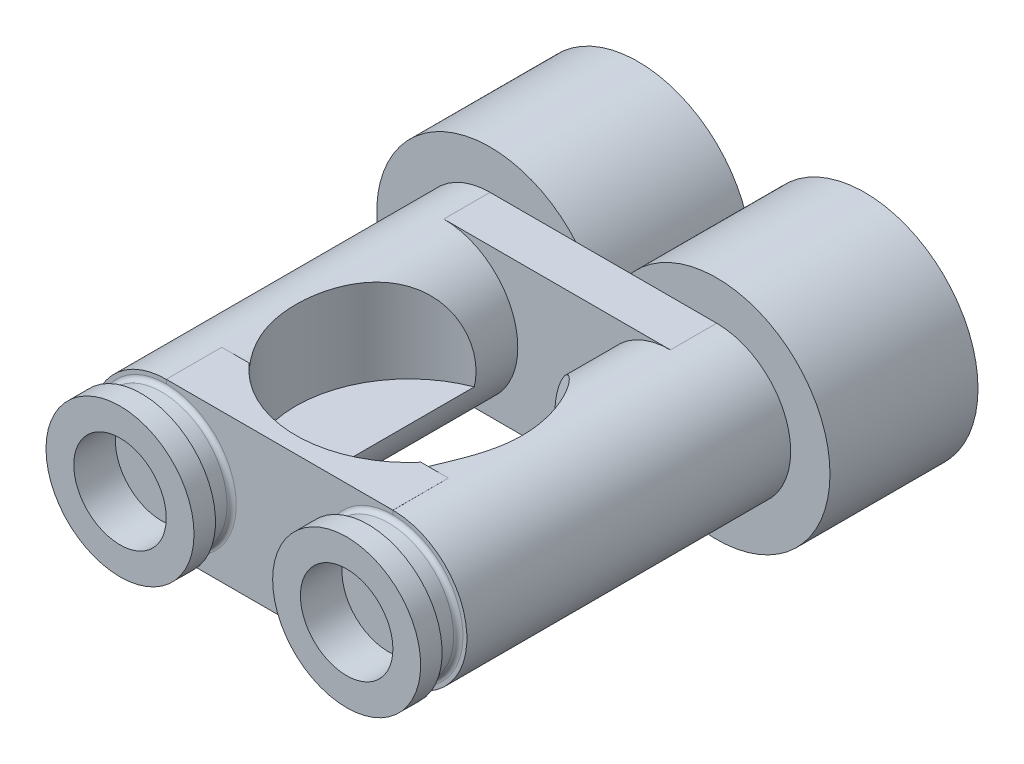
ISO-10303-21;
HEADER;
FILE_DESCRIPTION(('STEP AP214'),'2;1');
FILE_NAME('part.step','',(''),(''),'','','');
FILE_SCHEMA(('AUTOMOTIVE_DESIGN { 1 0 10303 214 1 1 1 1 }'));
ENDSEC;
DATA;
#1=APPLICATION_CONTEXT('core data for automotive mechanical design processes');
#2=APPLICATION_PROTOCOL_DEFINITION('international standard','automotive_design',2000,#1);
#3=PRODUCT_CONTEXT('',#1,'mechanical');
#4=PRODUCT('Part','Part','',(#3));
#5=PRODUCT_RELATED_PRODUCT_CATEGORY('part','',(#4));
#6=PRODUCT_DEFINITION_FORMATION('','',#4);
#7=PRODUCT_DEFINITION_CONTEXT('part definition',#1,'design');
#8=PRODUCT_DEFINITION('design','',#6,#7);
#9=PRODUCT_DEFINITION_SHAPE('','',#8);
#10=(LENGTH_UNIT() NAMED_UNIT(*) SI_UNIT(.MILLI.,.METRE.));
#11=(NAMED_UNIT(*) PLANE_ANGLE_UNIT() SI_UNIT($,.RADIAN.));
#12=(NAMED_UNIT(*) SI_UNIT($,.STERADIAN.) SOLID_ANGLE_UNIT());
#13=UNCERTAINTY_MEASURE_WITH_UNIT(LENGTH_MEASURE(1.E-05),#10,'distance_accuracy_value','');
#14=(GEOMETRIC_REPRESENTATION_CONTEXT(3) GLOBAL_UNCERTAINTY_ASSIGNED_CONTEXT((#13)) GLOBAL_UNIT_ASSIGNED_CONTEXT((#10,
#11,#12)) REPRESENTATION_CONTEXT('',''));
#15=CARTESIAN_POINT('',(0.,0.,0.));
#16=DIRECTION('',(0.,0.,1.));
#17=DIRECTION('',(1.,0.,0.));
#18=AXIS2_PLACEMENT_3D('',#15,#16,#17);
#19=CARTESIAN_POINT('',(0.,1.6,4.2));
#20=DIRECTION('',(1.,0.,0.));
#21=DIRECTION('',(0.,0.,-1.));
#22=AXIS2_PLACEMENT_3D('',#19,#20,#21);
#23=PLANE('',#22);
#24=DIRECTION('',(0.,-1.,0.));
#25=VECTOR('',#24,1.);
#26=CARTESIAN_POINT('',(0.,1.6,3.2));
#27=LINE('',#26,#25);
#28=CARTESIAN_POINT('',(0.,1.6,3.2));
#29=VERTEX_POINT('',#28);
#30=CARTESIAN_POINT('',(0.,-1.6,3.2));
#31=VERTEX_POINT('',#30);
#32=EDGE_CURVE('E81',#29,#31,#27,.T.);
#33=ORIENTED_EDGE('',*,*,#32,.T.);
#34=DIRECTION('',(0.,0.,-1.));
#35=VECTOR('',#34,1.);
#36=CARTESIAN_POINT('',(0.,-1.6,4.2));
#37=LINE('',#36,#35);
#38=CARTESIAN_POINT('',(0.,-1.6,4.2));
#39=VERTEX_POINT('',#38);
#40=EDGE_CURVE('E12',#39,#31,#37,.T.);
#41=ORIENTED_EDGE('',*,*,#40,.F.);
#42=DIRECTION('',(0.,-1.,0.));
#43=VECTOR('',#42,1.);
#44=CARTESIAN_POINT('',(0.,1.6,4.2));
#45=LINE('',#44,#43);
#46=CARTESIAN_POINT('',(0.,1.6,4.2));
#47=VERTEX_POINT('',#46);
#48=EDGE_CURVE('E99',#47,#39,#45,.T.);
#49=ORIENTED_EDGE('',*,*,#48,.F.);
#50=DIRECTION('',(0.,0.,-1.));
#51=VECTOR('',#50,1.);
#52=CARTESIAN_POINT('',(0.,1.6,4.2));
#53=LINE('',#52,#51);
#54=EDGE_CURVE('E93',#47,#29,#53,.T.);
#55=ORIENTED_EDGE('',*,*,#54,.T.);
#56=EDGE_LOOP('',(#33,#41,#49,#55));
#57=FACE_BOUND('',#56,.T.);
#58=ADVANCED_FACE('F37',(#57),#23,.F.);
#59=CARTESIAN_POINT('',(0.,-1.6,4.2));
#60=DIRECTION('',(0.,1.,0.));
#61=DIRECTION('',(0.,0.,1.));
#62=AXIS2_PLACEMENT_3D('',#59,#60,#61);
#63=PLANE('',#62);
#64=DIRECTION('',(1.,0.,0.));
#65=VECTOR('',#64,1.);
#66=CARTESIAN_POINT('',(0.,-1.6,3.2));
#67=LINE('',#66,#65);
#68=CARTESIAN_POINT('',(4.9,-1.6,3.2));
#69=VERTEX_POINT('',#68);
#70=EDGE_CURVE('E77',#31,#69,#67,.T.);
#71=ORIENTED_EDGE('',*,*,#70,.T.);
#72=DIRECTION('',(0.,0.,-1.));
#73=VECTOR('',#72,1.);
#74=CARTESIAN_POINT('',(4.9,-1.6,4.2));
#75=LINE('',#74,#73);
#76=CARTESIAN_POINT('',(4.9,-1.6,4.2));
#77=VERTEX_POINT('',#76);
#78=EDGE_CURVE('E44',#77,#69,#75,.T.);
#79=ORIENTED_EDGE('',*,*,#78,.F.);
#80=DIRECTION('',(1.,0.,0.));
#81=VECTOR('',#80,1.);
#82=CARTESIAN_POINT('',(0.,-1.6,4.2));
#83=LINE('',#82,#81);
#84=EDGE_CURVE('E89',#39,#77,#83,.T.);
#85=ORIENTED_EDGE('',*,*,#84,.F.);
#86=ORIENTED_EDGE('',*,*,#40,.T.);
#87=EDGE_LOOP('',(#71,#79,#85,#86));
#88=FACE_BOUND('',#87,.T.);
#89=ADVANCED_FACE('F88',(#88),#63,.F.);
#90=CARTESIAN_POINT('',(4.9,1.6,4.2));
#91=DIRECTION('',(-1.,0.,0.));
#92=DIRECTION('',(0.,0.,1.));
#93=AXIS2_PLACEMENT_3D('',#90,#91,#92);
#94=PLANE('',#93);
#95=DIRECTION('',(0.,1.,0.));
#96=VECTOR('',#95,1.);
#97=CARTESIAN_POINT('',(4.9,1.6,3.2));
#98=LINE('',#97,#96);
#99=CARTESIAN_POINT('',(4.9,1.6,3.2));
#100=VERTEX_POINT('',#99);
#101=EDGE_CURVE('E82',#69,#100,#98,.T.);
#102=ORIENTED_EDGE('',*,*,#101,.T.);
#103=DIRECTION('',(0.,0.,-1.));
#104=VECTOR('',#103,1.);
#105=CARTESIAN_POINT('',(4.9,1.6,4.2));
#106=LINE('',#105,#104);
#107=CARTESIAN_POINT('',(4.9,1.6,4.2));
#108=VERTEX_POINT('',#107);
#109=EDGE_CURVE('E105',#108,#100,#106,.T.);
#110=ORIENTED_EDGE('',*,*,#109,.F.);
#111=DIRECTION('',(0.,1.,0.));
#112=VECTOR('',#111,1.);
#113=CARTESIAN_POINT('',(4.9,1.6,4.2));
#114=LINE('',#113,#112);
#115=EDGE_CURVE('E56',#77,#108,#114,.T.);
#116=ORIENTED_EDGE('',*,*,#115,.F.);
#117=ORIENTED_EDGE('',*,*,#78,.T.);
#118=EDGE_LOOP('',(#102,#110,#116,#117));
#119=FACE_BOUND('',#118,.T.);
#120=ADVANCED_FACE('F108',(#119),#94,.F.);
#121=CARTESIAN_POINT('',(0.,1.6,4.2));
#122=DIRECTION('',(0.,-1.,0.));
#123=DIRECTION('',(0.,0.,-1.));
#124=AXIS2_PLACEMENT_3D('',#121,#122,#123);
#125=PLANE('',#124);
#126=DIRECTION('',(-1.,0.,0.));
#127=VECTOR('',#126,1.);
#128=CARTESIAN_POINT('',(0.,1.6,3.2));
#129=LINE('',#128,#127);
#130=EDGE_CURVE('E97',#100,#29,#129,.T.);
#131=ORIENTED_EDGE('',*,*,#130,.T.);
#132=ORIENTED_EDGE('',*,*,#54,.F.);
#133=DIRECTION('',(-1.,0.,0.));
#134=VECTOR('',#133,1.);
#135=CARTESIAN_POINT('',(0.,1.6,4.2));
#136=LINE('',#135,#134);
#137=EDGE_CURVE('E51',#108,#47,#136,.T.);
#138=ORIENTED_EDGE('',*,*,#137,.F.);
#139=ORIENTED_EDGE('',*,*,#109,.T.);
#140=EDGE_LOOP('',(#131,#132,#138,#139));
#141=FACE_BOUND('',#140,.T.);
#142=ADVANCED_FACE('F110',(#141),#125,.F.);
#143=CARTESIAN_POINT('',(0.,-1.6,4.2));
#144=DIRECTION('',(0.,0.,1.));
#145=DIRECTION('',(1.,0.,0.));
#146=AXIS2_PLACEMENT_3D('',#143,#144,#145);
#147=PLANE('',#146);
#148=ORIENTED_EDGE('',*,*,#48,.T.);
#149=ORIENTED_EDGE('',*,*,#84,.T.);
#150=ORIENTED_EDGE('',*,*,#115,.T.);
#151=ORIENTED_EDGE('',*,*,#137,.T.);
#152=EDGE_LOOP('',(#148,#149,#150,#151));
#153=FACE_BOUND('',#152,.T.);
#154=ADVANCED_FACE('F111',(#153),#147,.T.);
#155=CARTESIAN_POINT('',(0.,-1.6,3.2));
#156=DIRECTION('',(0.,0.,1.));
#157=DIRECTION('',(1.,0.,0.));
#158=AXIS2_PLACEMENT_3D('',#155,#156,#157);
#159=PLANE('',#158);
#160=ORIENTED_EDGE('',*,*,#32,.F.);
#161=ORIENTED_EDGE('',*,*,#130,.F.);
#162=ORIENTED_EDGE('',*,*,#101,.F.);
#163=ORIENTED_EDGE('',*,*,#70,.F.);
#164=EDGE_LOOP('',(#160,#161,#162,#163));
#165=FACE_BOUND('',#164,.T.);
#166=ADVANCED_FACE('F78',(#165),#159,.F.);
#167=CLOSED_SHELL('',(#58,#89,#120,#142,#154,#166));
#168=MANIFOLD_SOLID_BREP('B2',#167);
#169=CARTESIAN_POINT('',(0.,-1.6,9.));
#170=DIRECTION('',(-1.,0.,0.));
#171=DIRECTION('',(0.,0.,1.));
#172=AXIS2_PLACEMENT_3D('',#169,#170,#171);
#173=PLANE('',#172);
#174=DIRECTION('',(0.,-1.,0.));
#175=VECTOR('',#174,1.);
#176=CARTESIAN_POINT('',(0.,-1.6,10.2));
#177=LINE('',#176,#175);
#178=CARTESIAN_POINT('',(0.,1.6,10.2));
#179=VERTEX_POINT('',#178);
#180=CARTESIAN_POINT('',(0.,-1.6,10.2));
#181=VERTEX_POINT('',#180);
#182=EDGE_CURVE('E257',#179,#181,#177,.T.);
#183=ORIENTED_EDGE('',*,*,#182,.F.);
#184=DIRECTION('',(0.,0.,1.));
#185=VECTOR('',#184,1.);
#186=CARTESIAN_POINT('',(0.,1.6,9.));
#187=LINE('',#186,#185);
#188=CARTESIAN_POINT('',(0.,1.6,9.));
#189=VERTEX_POINT('',#188);
#190=EDGE_CURVE('E233',#189,#179,#187,.T.);
#191=ORIENTED_EDGE('',*,*,#190,.F.);
#192=DIRECTION('',(0.,-1.,0.));
#193=VECTOR('',#192,1.);
#194=CARTESIAN_POINT('',(0.,-1.6,9.));
#195=LINE('',#194,#193);
#196=CARTESIAN_POINT('',(0.,-1.6,9.));
#197=VERTEX_POINT('',#196);
#198=EDGE_CURVE('E263',#189,#197,#195,.T.);
#199=ORIENTED_EDGE('',*,*,#198,.T.);
#200=DIRECTION('',(0.,0.,1.));
#201=VECTOR('',#200,1.);
#202=CARTESIAN_POINT('',(0.,-1.6,9.));
#203=LINE('',#202,#201);
#204=EDGE_CURVE('E225',#197,#181,#203,.T.);
#205=ORIENTED_EDGE('',*,*,#204,.T.);
#206=EDGE_LOOP('',(#183,#191,#199,#205));
#207=FACE_BOUND('',#206,.T.);
#208=ADVANCED_FACE('F158',(#207),#173,.T.);
#209=CARTESIAN_POINT('',(0.,1.6,9.));
#210=DIRECTION('',(0.,1.,0.));
#211=DIRECTION('',(0.,0.,1.));
#212=AXIS2_PLACEMENT_3D('',#209,#210,#211);
#213=PLANE('',#212);
#214=CARTESIAN_POINT('',(2.45,1.6,7.4));
#215=DIRECTION('',(0.,1.,0.));
#216=DIRECTION('',(0.,0.,1.));
#217=AXIS2_PLACEMENT_3D('',#214,#215,#216);
#218=CIRCLE('',#217,2.45);
#219=CARTESIAN_POINT('',(0.594602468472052,1.6,9.));
#220=VERTEX_POINT('',#219);
#221=CARTESIAN_POINT('',(4.30539753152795,1.6,9.));
#222=VERTEX_POINT('',#221);
#223=EDGE_CURVE('E208',#220,#222,#218,.T.);
#224=ORIENTED_EDGE('',*,*,#223,.F.);
#225=DIRECTION('',(-1.,0.,0.));
#226=VECTOR('',#225,1.);
#227=CARTESIAN_POINT('',(0.,1.6,9.));
#228=LINE('',#227,#226);
#229=EDGE_CURVE('E179',#220,#189,#228,.T.);
#230=ORIENTED_EDGE('',*,*,#229,.T.);
#231=ORIENTED_EDGE('',*,*,#190,.T.);
#232=DIRECTION('',(-1.,0.,0.));
#233=VECTOR('',#232,1.);
#234=CARTESIAN_POINT('',(0.,1.6,10.2));
#235=LINE('',#234,#233);
#236=CARTESIAN_POINT('',(4.9,1.6,10.2));
#237=VERTEX_POINT('',#236);
#238=EDGE_CURVE('E253',#237,#179,#235,.T.);
#239=ORIENTED_EDGE('',*,*,#238,.F.);
#240=DIRECTION('',(0.,0.,1.));
#241=VECTOR('',#240,1.);
#242=CARTESIAN_POINT('',(4.9,1.6,9.));
#243=LINE('',#242,#241);
#244=CARTESIAN_POINT('',(4.9,1.6,9.));
#245=VERTEX_POINT('',#244);
#246=EDGE_CURVE('E223',#245,#237,#243,.T.);
#247=ORIENTED_EDGE('',*,*,#246,.F.);
#248=EDGE_CURVE('E219',#245,#222,#228,.T.);
#249=ORIENTED_EDGE('',*,*,#248,.T.);
#250=EDGE_LOOP('',(#224,#230,#231,#239,#247,#249));
#251=FACE_BOUND('',#250,.T.);
#252=ADVANCED_FACE('F221',(#251),#213,.T.);
#253=CARTESIAN_POINT('',(4.9,-1.6,9.));
#254=DIRECTION('',(1.,0.,0.));
#255=DIRECTION('',(0.,0.,-1.));
#256=AXIS2_PLACEMENT_3D('',#253,#254,#255);
#257=PLANE('',#256);
#258=DIRECTION('',(0.,1.,0.));
#259=VECTOR('',#258,1.);
#260=CARTESIAN_POINT('',(4.9,-1.6,10.2));
#261=LINE('',#260,#259);
#262=CARTESIAN_POINT('',(4.9,-1.6,10.2));
#263=VERTEX_POINT('',#262);
#264=EDGE_CURVE('E249',#263,#237,#261,.T.);
#265=ORIENTED_EDGE('',*,*,#264,.F.);
#266=DIRECTION('',(0.,0.,1.));
#267=VECTOR('',#266,1.);
#268=CARTESIAN_POINT('',(4.9,-1.6,9.));
#269=LINE('',#268,#267);
#270=CARTESIAN_POINT('',(4.9,-1.6,9.));
#271=VERTEX_POINT('',#270);
#272=EDGE_CURVE('E227',#271,#263,#269,.T.);
#273=ORIENTED_EDGE('',*,*,#272,.F.);
#274=DIRECTION('',(0.,1.,0.));
#275=VECTOR('',#274,1.);
#276=CARTESIAN_POINT('',(4.9,-1.6,9.));
#277=LINE('',#276,#275);
#278=EDGE_CURVE('E229',#271,#245,#277,.T.);
#279=ORIENTED_EDGE('',*,*,#278,.T.);
#280=ORIENTED_EDGE('',*,*,#246,.T.);
#281=EDGE_LOOP('',(#265,#273,#279,#280));
#282=FACE_BOUND('',#281,.T.);
#283=ADVANCED_FACE('F250',(#282),#257,.T.);
#284=CARTESIAN_POINT('',(0.,-1.6,9.));
#285=DIRECTION('',(0.,-1.,0.));
#286=DIRECTION('',(0.,0.,-1.));
#287=AXIS2_PLACEMENT_3D('',#284,#285,#286);
#288=PLANE('',#287);
#289=DIRECTION('',(1.,0.,0.));
#290=VECTOR('',#289,1.);
#291=CARTESIAN_POINT('',(0.,-1.6,10.2));
#292=LINE('',#291,#290);
#293=EDGE_CURVE('E243',#181,#263,#292,.T.);
#294=ORIENTED_EDGE('',*,*,#293,.F.);
#295=ORIENTED_EDGE('',*,*,#204,.F.);
#296=DIRECTION('',(1.,0.,0.));
#297=VECTOR('',#296,1.);
#298=CARTESIAN_POINT('',(0.,-1.6,9.));
#299=LINE('',#298,#297);
#300=EDGE_CURVE('E246',#197,#271,#299,.T.);
#301=ORIENTED_EDGE('',*,*,#300,.T.);
#302=ORIENTED_EDGE('',*,*,#272,.T.);
#303=EDGE_LOOP('',(#294,#295,#301,#302));
#304=FACE_BOUND('',#303,.T.);
#305=ADVANCED_FACE('F241',(#304),#288,.T.);
#306=CARTESIAN_POINT('',(0.,1.6,9.));
#307=DIRECTION('',(0.,0.,-1.));
#308=DIRECTION('',(-1.,0.,0.));
#309=AXIS2_PLACEMENT_3D('',#306,#307,#308);
#310=PLANE('',#309);
#311=DIRECTION('',(0.,1.,0.));
#312=VECTOR('',#311,1.);
#313=CARTESIAN_POINT('',(0.594602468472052,-0.3,9.));
#314=LINE('',#313,#312);
#315=CARTESIAN_POINT('',(0.594602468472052,-0.3,9.));
#316=VERTEX_POINT('',#315);
#317=EDGE_CURVE('E35',#316,#220,#314,.T.);
#318=ORIENTED_EDGE('',*,*,#317,.F.);
#319=DIRECTION('',(1.,0.,0.));
#320=VECTOR('',#319,1.);
#321=CARTESIAN_POINT('',(0.,-0.3,9.));
#322=LINE('',#321,#320);
#323=CARTESIAN_POINT('',(4.30539753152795,-0.3,9.));
#324=VERTEX_POINT('',#323);
#325=EDGE_CURVE('E220',#316,#324,#322,.T.);
#326=ORIENTED_EDGE('',*,*,#325,.T.);
#327=DIRECTION('',(0.,1.,0.));
#328=VECTOR('',#327,1.);
#329=CARTESIAN_POINT('',(4.30539753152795,-0.3,9.));
#330=LINE('',#329,#328);
#331=EDGE_CURVE('E165',#222,#324,#330,.F.);
#332=ORIENTED_EDGE('',*,*,#331,.F.);
#333=ORIENTED_EDGE('',*,*,#248,.F.);
#334=ORIENTED_EDGE('',*,*,#278,.F.);
#335=ORIENTED_EDGE('',*,*,#300,.F.);
#336=ORIENTED_EDGE('',*,*,#198,.F.);
#337=ORIENTED_EDGE('',*,*,#229,.F.);
#338=EDGE_LOOP('',(#318,#326,#332,#333,#334,#335,#336,#337));
#339=FACE_BOUND('',#338,.T.);
#340=ADVANCED_FACE('F217',(#339),#310,.T.);
#341=CARTESIAN_POINT('',(0.,1.6,10.2));
#342=DIRECTION('',(0.,0.,-1.));
#343=DIRECTION('',(-1.,0.,0.));
#344=AXIS2_PLACEMENT_3D('',#341,#342,#343);
#345=PLANE('',#344);
#346=ORIENTED_EDGE('',*,*,#182,.T.);
#347=ORIENTED_EDGE('',*,*,#293,.T.);
#348=ORIENTED_EDGE('',*,*,#264,.T.);
#349=ORIENTED_EDGE('',*,*,#238,.T.);
#350=EDGE_LOOP('',(#346,#347,#348,#349));
#351=FACE_BOUND('',#350,.T.);
#352=ADVANCED_FACE('F255',(#351),#345,.F.);
#353=CARTESIAN_POINT('',(2.45,-0.3,7.4));
#354=DIRECTION('',(0.,1.,0.));
#355=DIRECTION('',(0.,0.,1.));
#356=AXIS2_PLACEMENT_3D('',#353,#354,#355);
#357=CYLINDRICAL_SURFACE('',#356,2.45);
#358=ORIENTED_EDGE('',*,*,#317,.T.);
#359=ORIENTED_EDGE('',*,*,#223,.T.);
#360=ORIENTED_EDGE('',*,*,#331,.T.);
#361=CARTESIAN_POINT('',(2.45,-0.3,7.4));
#362=DIRECTION('',(0.,1.,0.));
#363=DIRECTION('',(0.,0.,1.));
#364=AXIS2_PLACEMENT_3D('',#361,#362,#363);
#365=CIRCLE('',#364,2.45);
#366=EDGE_CURVE('E171',#316,#324,#365,.T.);
#367=ORIENTED_EDGE('',*,*,#366,.F.);
#368=EDGE_LOOP('',(#358,#359,#360,#367));
#369=FACE_BOUND('',#368,.T.);
#370=ADVANCED_FACE('F210',(#369),#357,.F.);
#371=CARTESIAN_POINT('',(2.45,-0.3,7.4));
#372=DIRECTION('',(0.,1.,0.));
#373=DIRECTION('',(0.,0.,1.));
#374=AXIS2_PLACEMENT_3D('',#371,#372,#373);
#375=PLANE('',#374);
#376=ORIENTED_EDGE('',*,*,#366,.T.);
#377=ORIENTED_EDGE('',*,*,#325,.F.);
#378=EDGE_LOOP('',(#376,#377));
#379=FACE_BOUND('',#378,.T.);
#380=ADVANCED_FACE('F288',(#379),#375,.T.);
#381=CLOSED_SHELL('',(#208,#252,#283,#305,#340,#352,#370,#380));
#382=MANIFOLD_SOLID_BREP('B6',#381);
#383=CARTESIAN_POINT('',(4.9,0.,11.2));
#384=DIRECTION('',(0.,0.,-1.));
#385=DIRECTION('',(-1.,0.,0.));
#386=AXIS2_PLACEMENT_3D('',#383,#384,#385);
#387=CYLINDRICAL_SURFACE('',#386,1.6);
#388=CARTESIAN_POINT('',(4.9,0.,10.7353599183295));
#389=DIRECTION('',(0.,0.,-1.));
#390=DIRECTION('',(-1.,0.,0.));
#391=AXIS2_PLACEMENT_3D('',#388,#389,#390);
#392=CIRCLE('',#391,1.6);
#393=CARTESIAN_POINT('',(3.3,0.,10.7353599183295));
#394=VERTEX_POINT('',#393);
#395=EDGE_CURVE('E352',#394,#394,#392,.T.);
#396=ORIENTED_EDGE('',*,*,#395,.F.);
#397=EDGE_LOOP('',(#396));
#398=FACE_BOUND('',#397,.T.);
#399=CARTESIAN_POINT('',(4.9,0.,11.2));
#400=DIRECTION('',(0.,0.,1.));
#401=DIRECTION('',(1.,0.,0.));
#402=AXIS2_PLACEMENT_3D('',#399,#400,#401);
#403=CIRCLE('',#402,1.6);
#404=CARTESIAN_POINT('',(6.5,0.,11.2));
#405=VERTEX_POINT('',#404);
#406=EDGE_CURVE('E367',#405,#405,#403,.T.);
#407=ORIENTED_EDGE('',*,*,#406,.F.);
#408=EDGE_LOOP('',(#407));
#409=FACE_BOUND('',#408,.T.);
#410=ADVANCED_FACE('F325',(#398,#409),#387,.T.);
#411=CARTESIAN_POINT('',(4.9,0.,11.2));
#412=DIRECTION('',(0.,0.,1.));
#413=DIRECTION('',(1.,0.,0.));
#414=AXIS2_PLACEMENT_3D('',#411,#412,#413);
#415=PLANE('',#414);
#416=CARTESIAN_POINT('',(4.9,0.,11.2));
#417=DIRECTION('',(0.,0.,1.));
#418=DIRECTION('',(1.,0.,0.));
#419=AXIS2_PLACEMENT_3D('',#416,#417,#418);
#420=CIRCLE('',#419,1.);
#421=CARTESIAN_POINT('',(5.9,0.,11.2));
#422=VERTEX_POINT('',#421);
#423=EDGE_CURVE('E374',#422,#422,#420,.T.);
#424=ORIENTED_EDGE('',*,*,#423,.F.);
#425=EDGE_LOOP('',(#424));
#426=FACE_BOUND('',#425,.T.);
#427=ORIENTED_EDGE('',*,*,#406,.T.);
#428=EDGE_LOOP('',(#427));
#429=FACE_BOUND('',#428,.T.);
#430=ADVANCED_FACE('F410',(#426,#429),#415,.T.);
#431=CARTESIAN_POINT('',(4.9,0.,10.3));
#432=DIRECTION('',(0.,0.,1.));
#433=DIRECTION('',(1.,0.,0.));
#434=AXIS2_PLACEMENT_3D('',#431,#432,#433);
#435=CYLINDRICAL_SURFACE('',#434,1.);
#436=CARTESIAN_POINT('',(4.9,0.,10.3));
#437=DIRECTION('',(0.,0.,1.));
#438=DIRECTION('',(1.,0.,0.));
#439=AXIS2_PLACEMENT_3D('',#436,#437,#438);
#440=CIRCLE('',#439,1.);
#441=CARTESIAN_POINT('',(5.9,0.,10.3));
#442=VERTEX_POINT('',#441);
#443=EDGE_CURVE('E368',#442,#442,#440,.T.);
#444=ORIENTED_EDGE('',*,*,#443,.F.);
#445=EDGE_LOOP('',(#444));
#446=FACE_BOUND('',#445,.T.);
#447=ORIENTED_EDGE('',*,*,#423,.T.);
#448=EDGE_LOOP('',(#447));
#449=FACE_BOUND('',#448,.T.);
#450=ADVANCED_FACE('F417',(#446,#449),#435,.F.);
#451=CARTESIAN_POINT('',(4.9,0.,10.3));
#452=DIRECTION('',(0.,0.,1.));
#453=DIRECTION('',(1.,0.,0.));
#454=AXIS2_PLACEMENT_3D('',#451,#452,#453);
#455=PLANE('',#454);
#456=ORIENTED_EDGE('',*,*,#443,.T.);
#457=EDGE_LOOP('',(#456));
#458=FACE_BOUND('',#457,.T.);
#459=ADVANCED_FACE('F448',(#458),#455,.T.);
#460=CARTESIAN_POINT('',(4.9,1.6,10.7353599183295));
#461=DIRECTION('',(0.,0.,1.));
#462=DIRECTION('',(1.,0.,0.));
#463=AXIS2_PLACEMENT_3D('',#460,#461,#462);
#464=PLANE('',#463);
#465=CARTESIAN_POINT('',(4.9,0.,10.7353599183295));
#466=DIRECTION('',(0.,0.,1.));
#467=DIRECTION('',(1.,0.,0.));
#468=AXIS2_PLACEMENT_3D('',#465,#466,#467);
#469=CIRCLE('',#468,1.51379637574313);
#470=CARTESIAN_POINT('',(6.41379637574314,0.,10.7353599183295));
#471=VERTEX_POINT('',#470);
#472=EDGE_CURVE('E389',#471,#471,#469,.T.);
#473=ORIENTED_EDGE('',*,*,#472,.T.);
#474=EDGE_LOOP('',(#473));
#475=FACE_BOUND('',#474,.T.);
#476=ORIENTED_EDGE('',*,*,#395,.T.);
#477=EDGE_LOOP('',(#476));
#478=FACE_BOUND('',#477,.T.);
#479=ADVANCED_FACE('F443',(#475,#478),#464,.F.);
#480=CARTESIAN_POINT('',(4.9,0.,0.));
#481=DIRECTION('',(0.,0.,-1.));
#482=DIRECTION('',(-1.,0.,0.));
#483=AXIS2_PLACEMENT_3D('',#480,#481,#482);
#484=CYLINDRICAL_SURFACE('',#483,1.41379637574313);
#485=CARTESIAN_POINT('',(4.9,0.,10.6353599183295));
#486=DIRECTION('',(0.,0.,1.));
#487=DIRECTION('',(1.,0.,0.));
#488=AXIS2_PLACEMENT_3D('',#485,#486,#487);
#489=CIRCLE('',#488,1.41379637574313);
#490=CARTESIAN_POINT('',(6.31379637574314,0.,10.6353599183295));
#491=VERTEX_POINT('',#490);
#492=EDGE_CURVE('E386',#491,#491,#489,.F.);
#493=ORIENTED_EDGE('',*,*,#492,.T.);
#494=EDGE_LOOP('',(#493));
#495=FACE_BOUND('',#494,.T.);
#496=CARTESIAN_POINT('',(4.9,0.,10.3));
#497=DIRECTION('',(0.,0.,-1.));
#498=DIRECTION('',(-1.,0.,0.));
#499=AXIS2_PLACEMENT_3D('',#496,#497,#498);
#500=CIRCLE('',#499,1.41379637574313);
#501=CARTESIAN_POINT('',(3.48620362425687,0.,10.3));
#502=VERTEX_POINT('',#501);
#503=EDGE_CURVE('E383',#502,#502,#500,.F.);
#504=ORIENTED_EDGE('',*,*,#503,.T.);
#505=EDGE_LOOP('',(#504));
#506=FACE_BOUND('',#505,.T.);
#507=ADVANCED_FACE('F435',(#495,#506),#484,.T.);
#508=CARTESIAN_POINT('',(4.9,1.6,10.2));
#509=DIRECTION('',(0.,0.,-1.));
#510=DIRECTION('',(-1.,0.,0.));
#511=AXIS2_PLACEMENT_3D('',#508,#509,#510);
#512=PLANE('',#511);
#513=CARTESIAN_POINT('',(4.9,0.,10.2));
#514=DIRECTION('',(0.,0.,-1.));
#515=DIRECTION('',(-1.,0.,0.));
#516=AXIS2_PLACEMENT_3D('',#513,#514,#515);
#517=CIRCLE('',#516,1.51379637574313);
#518=CARTESIAN_POINT('',(3.38620362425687,0.,10.2));
#519=VERTEX_POINT('',#518);
#520=EDGE_CURVE('E350',#519,#519,#517,.T.);
#521=ORIENTED_EDGE('',*,*,#520,.T.);
#522=EDGE_LOOP('',(#521));
#523=FACE_BOUND('',#522,.T.);
#524=CARTESIAN_POINT('',(4.9,0.,10.2));
#525=DIRECTION('',(0.,0.,-1.));
#526=DIRECTION('',(-1.,0.,0.));
#527=AXIS2_PLACEMENT_3D('',#524,#525,#526);
#528=CIRCLE('',#527,1.6);
#529=CARTESIAN_POINT('',(3.3,0.,10.2));
#530=VERTEX_POINT('',#529);
#531=EDGE_CURVE('E362',#530,#530,#528,.T.);
#532=ORIENTED_EDGE('',*,*,#531,.F.);
#533=EDGE_LOOP('',(#532));
#534=FACE_BOUND('',#533,.T.);
#535=ADVANCED_FACE('F395',(#523,#534),#512,.F.);
#536=CARTESIAN_POINT('',(4.9,0.,0.));
#537=DIRECTION('',(0.,0.,1.));
#538=DIRECTION('',(1.,0.,0.));
#539=AXIS2_PLACEMENT_3D('',#536,#537,#538);
#540=PLANE('',#539);
#541=CARTESIAN_POINT('',(4.9,0.,0.));
#542=DIRECTION('',(0.,0.,1.));
#543=DIRECTION('',(1.,0.,0.));
#544=AXIS2_PLACEMENT_3D('',#541,#542,#543);
#545=CIRCLE('',#544,2.45);
#546=CARTESIAN_POINT('',(7.35,0.,0.));
#547=VERTEX_POINT('',#546);
#548=EDGE_CURVE('E380',#547,#547,#545,.T.);
#549=ORIENTED_EDGE('',*,*,#548,.F.);
#550=EDGE_LOOP('',(#549));
#551=FACE_BOUND('',#550,.T.);
#552=ADVANCED_FACE('F427',(#551),#540,.F.);
#553=CARTESIAN_POINT('',(4.9,0.,0.));
#554=DIRECTION('',(0.,0.,1.));
#555=DIRECTION('',(1.,0.,0.));
#556=AXIS2_PLACEMENT_3D('',#553,#554,#555);
#557=CYLINDRICAL_SURFACE('',#556,2.45);
#558=ORIENTED_EDGE('',*,*,#548,.T.);
#559=EDGE_LOOP('',(#558));
#560=FACE_BOUND('',#559,.T.);
#561=CARTESIAN_POINT('',(4.9,0.,3.2));
#562=DIRECTION('',(0.,0.,1.));
#563=DIRECTION('',(1.,0.,0.));
#564=AXIS2_PLACEMENT_3D('',#561,#562,#563);
#565=CIRCLE('',#564,2.45);
#566=CARTESIAN_POINT('',(7.35,0.,3.2));
#567=VERTEX_POINT('',#566);
#568=EDGE_CURVE('E371',#567,#567,#565,.T.);
#569=ORIENTED_EDGE('',*,*,#568,.F.);
#570=EDGE_LOOP('',(#569));
#571=FACE_BOUND('',#570,.T.);
#572=ADVANCED_FACE('F327',(#560,#571),#557,.T.);
#573=CARTESIAN_POINT('',(4.9,0.,3.2));
#574=DIRECTION('',(0.,0.,1.));
#575=DIRECTION('',(1.,0.,0.));
#576=AXIS2_PLACEMENT_3D('',#573,#574,#575);
#577=PLANE('',#576);
#578=ORIENTED_EDGE('',*,*,#568,.T.);
#579=EDGE_LOOP('',(#578));
#580=FACE_BOUND('',#579,.T.);
#581=CARTESIAN_POINT('',(4.9,0.,3.2));
#582=DIRECTION('',(0.,0.,1.));
#583=DIRECTION('',(1.,0.,0.));
#584=AXIS2_PLACEMENT_3D('',#581,#582,#583);
#585=CIRCLE('',#584,1.6);
#586=CARTESIAN_POINT('',(6.5,0.,3.2));
#587=VERTEX_POINT('',#586);
#588=EDGE_CURVE('E365',#587,#587,#585,.T.);
#589=ORIENTED_EDGE('',*,*,#588,.F.);
#590=EDGE_LOOP('',(#589));
#591=FACE_BOUND('',#590,.T.);
#592=ADVANCED_FACE('F358',(#580,#591),#577,.T.);
#593=DIRECTION('',(0.,0.,-1.));
#594=VECTOR('',#593,1.);
#595=CARTESIAN_POINT('',(3.32837663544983,-0.3,11.2));
#596=LINE('',#595,#594);
#597=CARTESIAN_POINT('',(3.32837663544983,-0.3,5.1128720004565));
#598=VERTEX_POINT('',#597);
#599=CARTESIAN_POINT('',(3.32837663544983,-0.3,9.6871279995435));
#600=VERTEX_POINT('',#599);
#601=EDGE_CURVE('E338',#598,#600,#596,.F.);
#602=ORIENTED_EDGE('',*,*,#601,.F.);
#603=CARTESIAN_POINT('',(3.32837663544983,-0.3,5.1128720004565));
#604=CARTESIAN_POINT('',(3.32051809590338,-0.25885967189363,5.10986233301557));
#605=CARTESIAN_POINT('',(3.31427725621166,-0.217365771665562,5.10750379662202));
#606=CARTESIAN_POINT('',(3.30506779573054,-0.133966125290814,5.10404847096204));
#607=CARTESIAN_POINT('',(3.3020990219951,-0.0920603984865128,5.10295162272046));
#608=CARTESIAN_POINT('',(3.2994696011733,-0.00812307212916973,5.10197882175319));
#609=CARTESIAN_POINT('',(3.29980938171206,0.0339085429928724,5.10210302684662));
#610=CARTESIAN_POINT('',(3.303787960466,0.117782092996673,5.10357916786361));
#611=CARTESIAN_POINT('',(3.30742674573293,0.159624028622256,5.10493109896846));
#612=CARTESIAN_POINT('',(3.32326392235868,0.28446897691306,5.11088288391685));
#613=CARTESIAN_POINT('',(3.34038212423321,0.366824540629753,5.11737830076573));
#614=CARTESIAN_POINT('',(3.38703619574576,0.52717871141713,5.13613489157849));
#615=CARTESIAN_POINT('',(3.41656681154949,0.605179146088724,5.14839362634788));
#616=CARTESIAN_POINT('',(3.48638664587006,0.753909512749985,5.17967416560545));
#617=CARTESIAN_POINT('',(3.52657947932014,0.82469708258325,5.19863586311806));
#618=CARTESIAN_POINT('',(3.61572986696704,0.957627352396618,5.24452482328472));
#619=CARTESIAN_POINT('',(3.66468453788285,1.01977288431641,5.27144946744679));
#620=CARTESIAN_POINT('',(3.76679819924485,1.13200123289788,5.33312449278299));
#621=CARTESIAN_POINT('',(3.81977096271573,1.18240813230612,5.36759485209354));
#622=CARTESIAN_POINT('',(3.92816174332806,1.27299811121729,5.44501511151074));
#623=CARTESIAN_POINT('',(3.98357967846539,1.3131815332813,5.48796472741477));
#624=CARTESIAN_POINT('',(4.09475946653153,1.38420337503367,5.58267048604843));
#625=CARTESIAN_POINT('',(4.15051184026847,1.4148761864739,5.63456057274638));
#626=CARTESIAN_POINT('',(4.25883790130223,1.4671529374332,5.74572242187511));
#627=CARTESIAN_POINT('',(4.31140922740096,1.48875020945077,5.80499957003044));
#628=CARTESIAN_POINT('',(4.3967452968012,1.51925811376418,5.91141508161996));
#629=CARTESIAN_POINT('',(4.43079859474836,1.53003183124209,5.95701798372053));
#630=CARTESIAN_POINT('',(4.4959091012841,1.54850037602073,6.05091734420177));
#631=CARTESIAN_POINT('',(4.52696526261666,1.5561941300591,6.09921473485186));
#632=CARTESIAN_POINT('',(4.6151537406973,1.5755977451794,6.2476826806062));
#633=CARTESIAN_POINT('',(4.66726424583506,1.58361677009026,6.35137711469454));
#634=CARTESIAN_POINT('',(4.7570678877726,1.59425583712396,6.56702142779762));
#635=CARTESIAN_POINT('',(4.79450239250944,1.59678231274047,6.67908123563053));
#636=CARTESIAN_POINT('',(4.852862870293,1.59957540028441,6.90744314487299));
#637=CARTESIAN_POINT('',(4.87379487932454,1.59984283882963,7.02374367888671));
#638=CARTESIAN_POINT('',(4.89344692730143,1.59999759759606,7.20843458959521));
#639=CARTESIAN_POINT('',(4.89781778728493,1.59999787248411,7.27627580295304));
#640=CARTESIAN_POINT('',(4.90091078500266,1.60000187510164,7.41210711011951));
#641=CARTESIAN_POINT('',(4.89963236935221,1.60000560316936,7.48009721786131));
#642=CARTESIAN_POINT('',(4.89142540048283,1.59998190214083,7.61579786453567));
#643=CARTESIAN_POINT('',(4.88449140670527,1.59995444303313,7.68350807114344));
#644=CARTESIAN_POINT('',(4.86501617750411,1.59964717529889,7.81811589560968));
#645=CARTESIAN_POINT('',(4.85247508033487,1.59936737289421,7.88501353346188));
#646=CARTESIAN_POINT('',(4.82165202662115,1.59815605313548,8.01848604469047));
#647=CARTESIAN_POINT('',(4.80328990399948,1.59721519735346,8.0850423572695));
#648=CARTESIAN_POINT('',(4.76102263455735,1.59409353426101,8.21635317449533));
#649=CARTESIAN_POINT('',(4.73711679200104,1.59191257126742,8.28110745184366));
#650=CARTESIAN_POINT('',(4.68398961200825,1.58557694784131,8.40823023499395));
#651=CARTESIAN_POINT('',(4.65477383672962,1.58142434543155,8.47060115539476));
#652=CARTESIAN_POINT('',(4.59133248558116,1.57027389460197,8.59244100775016));
#653=CARTESIAN_POINT('',(4.55710886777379,1.56327715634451,8.65191106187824));
#654=CARTESIAN_POINT('',(4.46780993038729,1.54148245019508,8.7930747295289));
#655=CARTESIAN_POINT('',(4.41022507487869,1.52459972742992,8.87290578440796));
#656=CARTESIAN_POINT('',(4.28771792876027,1.47964234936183,9.02316092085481));
#657=CARTESIAN_POINT('',(4.2228085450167,1.45158716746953,9.09360108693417));
#658=CARTESIAN_POINT('',(4.09940647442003,1.38677227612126,9.21334025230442));
#659=CARTESIAN_POINT('',(4.04143120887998,1.35197488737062,9.26422538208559));
#660=CARTESIAN_POINT('',(3.92592690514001,1.27127190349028,9.35694122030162));
#661=CARTESIAN_POINT('',(3.86839772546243,1.22536999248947,9.39877492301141));
#662=CARTESIAN_POINT('',(3.75715964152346,1.12235214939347,9.47324388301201));
#663=CARTESIAN_POINT('',(3.70346241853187,1.06520377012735,9.50585184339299));
#664=CARTESIAN_POINT('',(3.60346552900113,0.940934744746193,9.56225052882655));
#665=CARTESIAN_POINT('',(3.5571669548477,0.873812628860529,9.58603995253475));
#666=CARTESIAN_POINT('',(3.47680416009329,0.735255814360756,9.62487513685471));
#667=CARTESIAN_POINT('',(3.44223204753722,0.66422216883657,9.64030862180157));
#668=CARTESIAN_POINT('',(3.3837258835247,0.516910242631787,9.66531964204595));
#669=CARTESIAN_POINT('',(3.35979597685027,0.440629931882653,9.67489489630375));
#670=CARTESIAN_POINT('',(3.32307835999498,0.282925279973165,9.68924352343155));
#671=CARTESIAN_POINT('',(3.31059326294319,0.201419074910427,9.6938869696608));
#672=CARTESIAN_POINT('',(3.29832979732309,0.0373862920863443,9.69845251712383));
#673=CARTESIAN_POINT('',(3.29853474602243,-0.0451388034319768,9.69838081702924));
#674=CARTESIAN_POINT('',(3.30736139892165,-0.156071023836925,9.69508853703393));
#675=CARTESIAN_POINT('',(3.31047106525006,-0.185063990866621,9.69392805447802));
#676=CARTESIAN_POINT('',(3.31825646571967,-0.24275715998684,9.69099300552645));
#677=CARTESIAN_POINT('',(3.32292952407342,-0.271457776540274,9.68921948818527));
#678=CARTESIAN_POINT('',(3.32837663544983,-0.3,9.6871279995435));
#679=B_SPLINE_CURVE_WITH_KNOTS('',3,(#603,#604,#605,#606,#607,#608,#609,#610,#611,#612,#613,
#614,#615,#616,#617,#618,#619,#620,#621,#622,#623,#624,#625,#626,#627,#628,#629,#630,#631,#632,
#633,#634,#635,#636,#637,#638,#639,#640,#641,#642,#643,#644,#645,#646,#647,#648,#649,#650,#651,
#652,#653,#654,#655,#656,#657,#658,#659,#660,#661,#662,#663,#664,#665,#666,#667,#668,#669,#670,
#671,#672,#673,#674,#675,#676,#677,#678),.UNSPECIFIED.,.F.,.F.,(4,2,2,2,2,2,2,2,2,2,2,2,2,2,2,2,
2,2,2,2,2,2,2,2,2,2,2,2,2,2,2,2,2,2,2,2,2,4),(0.,0.12593410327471,0.25186231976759,
0.377806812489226,0.503750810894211,0.755539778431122,1.00722227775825,1.25670285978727,
1.50610149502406,1.74746645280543,1.98882332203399,2.23417333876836,2.47970329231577,
2.65325776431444,2.82687266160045,3.1743036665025,3.52760830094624,3.88078364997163,
4.08452650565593,4.28828931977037,4.49224838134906,4.69620241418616,4.90309710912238,
5.11001778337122,5.31672294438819,5.52334749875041,5.82175475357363,6.11964415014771,
6.37240927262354,6.6250906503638,6.87851201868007,7.1319707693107,7.3723553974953,
7.6128335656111,7.85950083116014,8.10584382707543,8.19335328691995,8.28071373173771),.UNSPECIFIED.);
#680=EDGE_CURVE('E156',#598,#600,#679,.T.);
#681=ORIENTED_EDGE('',*,*,#680,.T.);
#682=EDGE_LOOP('',(#602,#681));
#683=FACE_BOUND('',#682,.T.);
#684=ORIENTED_EDGE('',*,*,#531,.T.);
#685=EDGE_LOOP('',(#684));
#686=FACE_BOUND('',#685,.T.);
#687=ORIENTED_EDGE('',*,*,#588,.T.);
#688=EDGE_LOOP('',(#687));
#689=FACE_BOUND('',#688,.T.);
#690=ADVANCED_FACE('F354',(#683,#686,#689),#387,.T.);
#691=CARTESIAN_POINT('',(4.9,0.,10.6353599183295));
#692=DIRECTION('',(0.,0.,1.));
#693=DIRECTION('',(1.,0.,0.));
#694=AXIS2_PLACEMENT_3D('',#691,#692,#693);
#695=TOROIDAL_SURFACE('',#694,1.51379637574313,0.1);
#696=ORIENTED_EDGE('',*,*,#472,.F.);
#697=EDGE_LOOP('',(#696));
#698=FACE_BOUND('',#697,.T.);
#699=ORIENTED_EDGE('',*,*,#492,.F.);
#700=EDGE_LOOP('',(#699));
#701=FACE_BOUND('',#700,.T.);
#702=ADVANCED_FACE('F357',(#698,#701),#695,.F.);
#703=CARTESIAN_POINT('',(4.9,0.,10.3));
#704=DIRECTION('',(0.,0.,-1.));
#705=DIRECTION('',(-1.,0.,0.));
#706=AXIS2_PLACEMENT_3D('',#703,#704,#705);
#707=TOROIDAL_SURFACE('',#706,1.51379637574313,0.1);
#708=ORIENTED_EDGE('',*,*,#503,.F.);
#709=EDGE_LOOP('',(#708));
#710=FACE_BOUND('',#709,.T.);
#711=ORIENTED_EDGE('',*,*,#520,.F.);
#712=EDGE_LOOP('',(#711));
#713=FACE_BOUND('',#712,.T.);
#714=ADVANCED_FACE('F398',(#710,#713),#707,.F.);
#715=CARTESIAN_POINT('',(2.45,-0.3,7.4));
#716=DIRECTION('',(0.,1.,0.));
#717=DIRECTION('',(0.,0.,1.));
#718=AXIS2_PLACEMENT_3D('',#715,#716,#717);
#719=CYLINDRICAL_SURFACE('',#718,2.45);
#720=CARTESIAN_POINT('',(2.45,-0.3,7.4));
#721=DIRECTION('',(0.,1.,0.));
#722=DIRECTION('',(0.,0.,1.));
#723=AXIS2_PLACEMENT_3D('',#720,#721,#722);
#724=CIRCLE('',#723,2.45);
#725=EDGE_CURVE('E348',#600,#598,#724,.T.);
#726=ORIENTED_EDGE('',*,*,#725,.F.);
#727=ORIENTED_EDGE('',*,*,#680,.F.);
#728=EDGE_LOOP('',(#726,#727));
#729=FACE_BOUND('',#728,.T.);
#730=ADVANCED_FACE('F351',(#729),#719,.F.);
#731=CARTESIAN_POINT('',(2.45,-0.3,7.4));
#732=DIRECTION('',(0.,1.,0.));
#733=DIRECTION('',(0.,0.,1.));
#734=AXIS2_PLACEMENT_3D('',#731,#732,#733);
#735=PLANE('',#734);
#736=ORIENTED_EDGE('',*,*,#601,.T.);
#737=ORIENTED_EDGE('',*,*,#725,.T.);
#738=EDGE_LOOP('',(#736,#737));
#739=FACE_BOUND('',#738,.T.);
#740=ADVANCED_FACE('F347',(#739),#735,.T.);
#741=CLOSED_SHELL('',(#410,#430,#450,#459,#479,#507,#535,#552,#572,#592,#690,#702,#714,#730,#740));
#742=MANIFOLD_SOLID_BREP('B29',#741);
#743=CARTESIAN_POINT('',(0.,0.,11.2));
#744=DIRECTION('',(0.,0.,-1.));
#745=DIRECTION('',(-1.,0.,0.));
#746=AXIS2_PLACEMENT_3D('',#743,#744,#745);
#747=CYLINDRICAL_SURFACE('',#746,1.6);
#748=DIRECTION('',(0.,0.,-1.));
#749=VECTOR('',#748,1.);
#750=CARTESIAN_POINT('',(1.57162336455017,-0.3,11.2));
#751=LINE('',#750,#749);
#752=CARTESIAN_POINT('',(1.57162336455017,-0.3,9.6871279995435));
#753=VERTEX_POINT('',#752);
#754=CARTESIAN_POINT('',(1.57162336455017,-0.3,5.1128720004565));
#755=VERTEX_POINT('',#754);
#756=EDGE_CURVE('E537',#753,#755,#751,.T.);
#757=ORIENTED_EDGE('',*,*,#756,.F.);
#758=CARTESIAN_POINT('',(1.57162336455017,-0.3,9.6871279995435));
#759=CARTESIAN_POINT('',(1.57948190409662,-0.25885967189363,9.69013766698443));
#760=CARTESIAN_POINT('',(1.58572274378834,-0.217365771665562,9.69249620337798));
#761=CARTESIAN_POINT('',(1.59493220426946,-0.133966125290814,9.69595152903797));
#762=CARTESIAN_POINT('',(1.5979009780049,-0.0920603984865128,9.69704837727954));
#763=CARTESIAN_POINT('',(1.60053039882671,-0.00812307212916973,9.69802117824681));
#764=CARTESIAN_POINT('',(1.60019061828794,0.0339085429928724,9.69789697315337));
#765=CARTESIAN_POINT('',(1.596212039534,0.117782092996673,9.6964208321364));
#766=CARTESIAN_POINT('',(1.59257325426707,0.159624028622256,9.69506890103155));
#767=CARTESIAN_POINT('',(1.57673607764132,0.28446897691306,9.68911711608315));
#768=CARTESIAN_POINT('',(1.55961787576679,0.366824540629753,9.68262169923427));
#769=CARTESIAN_POINT('',(1.51296380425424,0.52717871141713,9.66386510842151));
#770=CARTESIAN_POINT('',(1.48343318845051,0.605179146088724,9.65160637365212));
#771=CARTESIAN_POINT('',(1.41361335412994,0.753909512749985,9.62032583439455));
#772=CARTESIAN_POINT('',(1.37342052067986,0.82469708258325,9.60136413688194));
#773=CARTESIAN_POINT('',(1.28427013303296,0.957627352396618,9.55547517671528));
#774=CARTESIAN_POINT('',(1.23531546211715,1.01977288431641,9.52855053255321));
#775=CARTESIAN_POINT('',(1.13320180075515,1.13200123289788,9.46687550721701));
#776=CARTESIAN_POINT('',(1.08022903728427,1.18240813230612,9.43240514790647));
#777=CARTESIAN_POINT('',(0.971838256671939,1.27299811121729,9.35498488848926));
#778=CARTESIAN_POINT('',(0.91642032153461,1.3131815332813,9.31203527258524));
#779=CARTESIAN_POINT('',(0.805240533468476,1.38420337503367,9.21732951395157));
#780=CARTESIAN_POINT('',(0.74948815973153,1.4148761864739,9.16543942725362));
#781=CARTESIAN_POINT('',(0.641162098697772,1.4671529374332,9.05427757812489));
#782=CARTESIAN_POINT('',(0.588590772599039,1.48875020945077,8.99500042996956));
#783=CARTESIAN_POINT('',(0.5032547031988,1.51925811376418,8.88858491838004));
#784=CARTESIAN_POINT('',(0.469201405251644,1.53003183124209,8.84298201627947));
#785=CARTESIAN_POINT('',(0.404090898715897,1.54850037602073,8.74908265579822));
#786=CARTESIAN_POINT('',(0.373034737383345,1.5561941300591,8.70078526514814));
#787=CARTESIAN_POINT('',(0.284846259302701,1.5755977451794,8.5523173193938));
#788=CARTESIAN_POINT('',(0.232735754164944,1.58361677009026,8.44862288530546));
#789=CARTESIAN_POINT('',(0.1429321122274,1.59425583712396,8.23297857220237));
#790=CARTESIAN_POINT('',(0.105497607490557,1.59678231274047,8.12091876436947));
#791=CARTESIAN_POINT('',(0.0471371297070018,1.59957540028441,7.89255685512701));
#792=CARTESIAN_POINT('',(0.0262051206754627,1.59984283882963,7.77625632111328));
#793=CARTESIAN_POINT('',(0.00655307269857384,1.59999759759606,7.59156541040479));
#794=CARTESIAN_POINT('',(0.00218221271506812,1.59999787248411,7.52372419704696));
#795=CARTESIAN_POINT('',(-0.000910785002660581,1.60000187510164,7.38789288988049));
#796=CARTESIAN_POINT('',(0.000367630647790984,1.60000560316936,7.31990278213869));
#797=CARTESIAN_POINT('',(0.00857459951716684,1.59998190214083,7.18420213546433));
#798=CARTESIAN_POINT('',(0.0155085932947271,1.59995444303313,7.11649192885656));
#799=CARTESIAN_POINT('',(0.03498382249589,1.59964717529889,6.98188410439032));
#800=CARTESIAN_POINT('',(0.047524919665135,1.59936737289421,6.91498646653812));
#801=CARTESIAN_POINT('',(0.0783479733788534,1.59815605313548,6.78151395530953));
#802=CARTESIAN_POINT('',(0.0967100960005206,1.59721519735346,6.7149576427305));
#803=CARTESIAN_POINT('',(0.138977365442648,1.59409353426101,6.58364682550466));
#804=CARTESIAN_POINT('',(0.162883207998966,1.59191257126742,6.51889254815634));
#805=CARTESIAN_POINT('',(0.216010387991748,1.58557694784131,6.39176976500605));
#806=CARTESIAN_POINT('',(0.245226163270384,1.58142434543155,6.32939884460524));
#807=CARTESIAN_POINT('',(0.308667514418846,1.57027389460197,6.20755899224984));
#808=CARTESIAN_POINT('',(0.342891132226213,1.56327715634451,6.14808893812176));
#809=CARTESIAN_POINT('',(0.43219006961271,1.54148245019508,6.0069252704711));
#810=CARTESIAN_POINT('',(0.489774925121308,1.52459972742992,5.92709421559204));
#811=CARTESIAN_POINT('',(0.612282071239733,1.47964234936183,5.77683907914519));
#812=CARTESIAN_POINT('',(0.677191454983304,1.45158716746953,5.70639891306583));
#813=CARTESIAN_POINT('',(0.800593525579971,1.38677227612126,5.58665974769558));
#814=CARTESIAN_POINT('',(0.858568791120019,1.35197488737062,5.53577461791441));
#815=CARTESIAN_POINT('',(0.974073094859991,1.27127190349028,5.44305877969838));
#816=CARTESIAN_POINT('',(1.03160227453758,1.22536999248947,5.40122507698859));
#817=CARTESIAN_POINT('',(1.14284035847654,1.12235214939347,5.32675611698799));
#818=CARTESIAN_POINT('',(1.19653758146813,1.06520377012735,5.29414815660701));
#819=CARTESIAN_POINT('',(1.29653447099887,0.940934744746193,5.23774947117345));
#820=CARTESIAN_POINT('',(1.3428330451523,0.873812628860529,5.21396004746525));
#821=CARTESIAN_POINT('',(1.42319583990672,0.735255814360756,5.17512486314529));
#822=CARTESIAN_POINT('',(1.45776795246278,0.66422216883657,5.15969137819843));
#823=CARTESIAN_POINT('',(1.51627411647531,0.516910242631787,5.13468035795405));
#824=CARTESIAN_POINT('',(1.54020402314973,0.440629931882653,5.12510510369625));
#825=CARTESIAN_POINT('',(1.57692164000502,0.282925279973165,5.11075647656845));
#826=CARTESIAN_POINT('',(1.58940673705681,0.201419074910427,5.1061130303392));
#827=CARTESIAN_POINT('',(1.60167020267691,0.0373862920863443,5.10154748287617));
#828=CARTESIAN_POINT('',(1.60146525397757,-0.045138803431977,5.10161918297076));
#829=CARTESIAN_POINT('',(1.59263860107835,-0.156071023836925,5.10491146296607));
#830=CARTESIAN_POINT('',(1.58952893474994,-0.185063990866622,5.10607194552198));
#831=CARTESIAN_POINT('',(1.58174353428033,-0.24275715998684,5.10900699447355));
#832=CARTESIAN_POINT('',(1.57707047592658,-0.271457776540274,5.11078051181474));
#833=CARTESIAN_POINT('',(1.57162336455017,-0.3,5.1128720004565));
#834=B_SPLINE_CURVE_WITH_KNOTS('',3,(#758,#759,#760,#761,#762,#763,#764,#765,#766,#767,#768,
#769,#770,#771,#772,#773,#774,#775,#776,#777,#778,#779,#780,#781,#782,#783,#784,#785,#786,#787,
#788,#789,#790,#791,#792,#793,#794,#795,#796,#797,#798,#799,#800,#801,#802,#803,#804,#805,#806,
#807,#808,#809,#810,#811,#812,#813,#814,#815,#816,#817,#818,#819,#820,#821,#822,#823,#824,#825,
#826,#827,#828,#829,#830,#831,#832,#833),.UNSPECIFIED.,.F.,.F.,(4,2,2,2,2,2,2,2,2,2,2,2,2,2,2,2,
2,2,2,2,2,2,2,2,2,2,2,2,2,2,2,2,2,2,2,2,2,4),(0.,0.12593410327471,0.25186231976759,
0.377806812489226,0.503750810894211,0.755539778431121,1.00722227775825,1.25670285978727,
1.50610149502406,1.74746645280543,1.98882332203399,2.23417333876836,2.47970329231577,
2.65325776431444,2.82687266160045,3.1743036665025,3.52760830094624,3.88078364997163,
4.08452650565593,4.28828931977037,4.49224838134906,4.69620241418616,4.90309710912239,
5.11001778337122,5.31672294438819,5.52334749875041,5.82175475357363,6.11964415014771,
6.37240927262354,6.6250906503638,6.87851201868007,7.1319707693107,7.3723553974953,
7.6128335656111,7.85950083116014,8.10584382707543,8.19335328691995,8.28071373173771),.UNSPECIFIED.);
#835=EDGE_CURVE('E323',#753,#755,#834,.T.);
#836=ORIENTED_EDGE('',*,*,#835,.T.);
#837=EDGE_LOOP('',(#757,#836));
#838=FACE_BOUND('',#837,.T.);
#839=CARTESIAN_POINT('',(0.,0.,10.2));
#840=DIRECTION('',(0.,0.,-1.));
#841=DIRECTION('',(-1.,0.,0.));
#842=AXIS2_PLACEMENT_3D('',#839,#840,#841);
#843=CIRCLE('',#842,1.6);
#844=CARTESIAN_POINT('',(-1.6,0.,10.2));
#845=VERTEX_POINT('',#844);
#846=EDGE_CURVE('E551',#845,#845,#843,.T.);
#847=ORIENTED_EDGE('',*,*,#846,.T.);
#848=EDGE_LOOP('',(#847));
#849=FACE_BOUND('',#848,.T.);
#850=CARTESIAN_POINT('',(0.,0.,3.2));
#851=DIRECTION('',(0.,0.,1.));
#852=DIRECTION('',(1.,0.,0.));
#853=AXIS2_PLACEMENT_3D('',#850,#851,#852);
#854=CIRCLE('',#853,1.6);
#855=CARTESIAN_POINT('',(1.6,0.,3.2));
#856=VERTEX_POINT('',#855);
#857=EDGE_CURVE('E562',#856,#856,#854,.T.);
#858=ORIENTED_EDGE('',*,*,#857,.T.);
#859=EDGE_LOOP('',(#858));
#860=FACE_BOUND('',#859,.T.);
#861=ADVANCED_FACE('F524',(#838,#849,#860),#747,.T.);
#862=CARTESIAN_POINT('',(0.,0.,3.2));
#863=DIRECTION('',(0.,0.,1.));
#864=DIRECTION('',(1.,0.,0.));
#865=AXIS2_PLACEMENT_3D('',#862,#863,#864);
#866=PLANE('',#865);
#867=CARTESIAN_POINT('',(0.,0.,3.2));
#868=DIRECTION('',(0.,0.,1.));
#869=DIRECTION('',(1.,0.,0.));
#870=AXIS2_PLACEMENT_3D('',#867,#868,#869);
#871=CIRCLE('',#870,2.45);
#872=CARTESIAN_POINT('',(2.45,0.,3.2));
#873=VERTEX_POINT('',#872);
#874=EDGE_CURVE('E577',#873,#873,#871,.T.);
#875=ORIENTED_EDGE('',*,*,#874,.T.);
#876=EDGE_LOOP('',(#875));
#877=FACE_BOUND('',#876,.T.);
#878=ORIENTED_EDGE('',*,*,#857,.F.);
#879=EDGE_LOOP('',(#878));
#880=FACE_BOUND('',#879,.T.);
#881=ADVANCED_FACE('F555',(#877,#880),#866,.T.);
#882=CARTESIAN_POINT('',(0.,0.,3.2));
#883=DIRECTION('',(0.,0.,-1.));
#884=DIRECTION('',(-1.,0.,0.));
#885=AXIS2_PLACEMENT_3D('',#882,#883,#884);
#886=CYLINDRICAL_SURFACE('',#885,2.45);
#887=ORIENTED_EDGE('',*,*,#874,.F.);
#888=EDGE_LOOP('',(#887));
#889=FACE_BOUND('',#888,.T.);
#890=CARTESIAN_POINT('',(0.,0.,0.));
#891=DIRECTION('',(0.,0.,1.));
#892=DIRECTION('',(1.,0.,0.));
#893=AXIS2_PLACEMENT_3D('',#890,#891,#892);
#894=CIRCLE('',#893,2.45);
#895=CARTESIAN_POINT('',(2.45,0.,0.));
#896=VERTEX_POINT('',#895);
#897=EDGE_CURVE('E568',#896,#896,#894,.T.);
#898=ORIENTED_EDGE('',*,*,#897,.T.);
#899=EDGE_LOOP('',(#898));
#900=FACE_BOUND('',#899,.T.);
#901=ADVANCED_FACE('F526',(#889,#900),#886,.T.);
#902=CARTESIAN_POINT('',(0.,0.,0.));
#903=DIRECTION('',(0.,0.,1.));
#904=DIRECTION('',(1.,0.,0.));
#905=AXIS2_PLACEMENT_3D('',#902,#903,#904);
#906=PLANE('',#905);
#907=ORIENTED_EDGE('',*,*,#897,.F.);
#908=EDGE_LOOP('',(#907));
#909=FACE_BOUND('',#908,.T.);
#910=ADVANCED_FACE('F621',(#909),#906,.F.);
#911=CARTESIAN_POINT('',(0.,1.6,10.2));
#912=DIRECTION('',(0.,0.,-1.));
#913=DIRECTION('',(-1.,0.,0.));
#914=AXIS2_PLACEMENT_3D('',#911,#912,#913);
#915=PLANE('',#914);
#916=CARTESIAN_POINT('',(0.,0.,10.2));
#917=DIRECTION('',(0.,0.,-1.));
#918=DIRECTION('',(-1.,0.,0.));
#919=AXIS2_PLACEMENT_3D('',#916,#917,#918);
#920=CIRCLE('',#919,1.51379637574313);
#921=CARTESIAN_POINT('',(-1.51379637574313,0.,10.2));
#922=VERTEX_POINT('',#921);
#923=EDGE_CURVE('E549',#922,#922,#920,.T.);
#924=ORIENTED_EDGE('',*,*,#923,.T.);
#925=EDGE_LOOP('',(#924));
#926=FACE_BOUND('',#925,.T.);
#927=ORIENTED_EDGE('',*,*,#846,.F.);
#928=EDGE_LOOP('',(#927));
#929=FACE_BOUND('',#928,.T.);
#930=ADVANCED_FACE('F592',(#926,#929),#915,.F.);
#931=CARTESIAN_POINT('',(0.,0.,0.));
#932=DIRECTION('',(0.,0.,-1.));
#933=DIRECTION('',(-1.,0.,0.));
#934=AXIS2_PLACEMENT_3D('',#931,#932,#933);
#935=CYLINDRICAL_SURFACE('',#934,1.41379637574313);
#936=CARTESIAN_POINT('',(0.,0.,10.6353599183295));
#937=DIRECTION('',(0.,0.,1.));
#938=DIRECTION('',(1.,0.,0.));
#939=AXIS2_PLACEMENT_3D('',#936,#937,#938);
#940=CIRCLE('',#939,1.41379637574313);
#941=CARTESIAN_POINT('',(1.41379637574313,0.,10.6353599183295));
#942=VERTEX_POINT('',#941);
#943=EDGE_CURVE('E583',#942,#942,#940,.F.);
#944=ORIENTED_EDGE('',*,*,#943,.T.);
#945=EDGE_LOOP('',(#944));
#946=FACE_BOUND('',#945,.T.);
#947=CARTESIAN_POINT('',(0.,0.,10.3));
#948=DIRECTION('',(0.,0.,-1.));
#949=DIRECTION('',(-1.,0.,0.));
#950=AXIS2_PLACEMENT_3D('',#947,#948,#949);
#951=CIRCLE('',#950,1.41379637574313);
#952=CARTESIAN_POINT('',(-1.41379637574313,0.,10.3));
#953=VERTEX_POINT('',#952);
#954=EDGE_CURVE('E580',#953,#953,#951,.F.);
#955=ORIENTED_EDGE('',*,*,#954,.T.);
#956=EDGE_LOOP('',(#955));
#957=FACE_BOUND('',#956,.T.);
#958=ADVANCED_FACE('F614',(#946,#957),#935,.T.);
#959=CARTESIAN_POINT('',(0.,1.6,10.7353599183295));
#960=DIRECTION('',(0.,0.,1.));
#961=DIRECTION('',(1.,0.,0.));
#962=AXIS2_PLACEMENT_3D('',#959,#960,#961);
#963=PLANE('',#962);
#964=CARTESIAN_POINT('',(0.,0.,10.7353599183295));
#965=DIRECTION('',(0.,0.,1.));
#966=DIRECTION('',(1.,0.,0.));
#967=AXIS2_PLACEMENT_3D('',#964,#965,#966);
#968=CIRCLE('',#967,1.51379637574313);
#969=CARTESIAN_POINT('',(1.51379637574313,0.,10.7353599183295));
#970=VERTEX_POINT('',#969);
#971=EDGE_CURVE('E586',#970,#970,#968,.T.);
#972=ORIENTED_EDGE('',*,*,#971,.T.);
#973=EDGE_LOOP('',(#972));
#974=FACE_BOUND('',#973,.T.);
#975=CARTESIAN_POINT('',(0.,0.,10.7353599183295));
#976=DIRECTION('',(0.,0.,-1.));
#977=DIRECTION('',(-1.,0.,0.));
#978=AXIS2_PLACEMENT_3D('',#975,#976,#977);
#979=CIRCLE('',#978,1.6);
#980=CARTESIAN_POINT('',(-1.6,0.,10.7353599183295));
#981=VERTEX_POINT('',#980);
#982=EDGE_CURVE('E707',#981,#981,#979,.T.);
#983=ORIENTED_EDGE('',*,*,#982,.T.);
#984=EDGE_LOOP('',(#983));
#985=FACE_BOUND('',#984,.T.);
#986=ADVANCED_FACE('F610',(#974,#985),#963,.F.);
#987=CARTESIAN_POINT('',(0.,0.,10.3));
#988=DIRECTION('',(0.,0.,1.));
#989=DIRECTION('',(1.,0.,0.));
#990=AXIS2_PLACEMENT_3D('',#987,#988,#989);
#991=PLANE('',#990);
#992=CARTESIAN_POINT('',(0.,0.,10.3));
#993=DIRECTION('',(0.,0.,1.));
#994=DIRECTION('',(1.,0.,0.));
#995=AXIS2_PLACEMENT_3D('',#992,#993,#994);
#996=CIRCLE('',#995,1.);
#997=CARTESIAN_POINT('',(1.,0.,10.3));
#998=VERTEX_POINT('',#997);
#999=EDGE_CURVE('E565',#998,#998,#996,.T.);
#1000=ORIENTED_EDGE('',*,*,#999,.T.);
#1001=EDGE_LOOP('',(#1000));
#1002=FACE_BOUND('',#1001,.T.);
#1003=ADVANCED_FACE('F613',(#1002),#991,.T.);
#1004=CARTESIAN_POINT('',(0.,0.,10.3));
#1005=DIRECTION('',(0.,0.,1.));
#1006=DIRECTION('',(1.,0.,0.));
#1007=AXIS2_PLACEMENT_3D('',#1004,#1005,#1006);
#1008=CYLINDRICAL_SURFACE('',#1007,1.);
#1009=ORIENTED_EDGE('',*,*,#999,.F.);
#1010=EDGE_LOOP('',(#1009));
#1011=FACE_BOUND('',#1010,.T.);
#1012=CARTESIAN_POINT('',(0.,0.,11.2));
#1013=DIRECTION('',(0.,0.,1.));
#1014=DIRECTION('',(1.,0.,0.));
#1015=AXIS2_PLACEMENT_3D('',#1012,#1013,#1014);
#1016=CIRCLE('',#1015,1.);
#1017=CARTESIAN_POINT('',(1.,0.,11.2));
#1018=VERTEX_POINT('',#1017);
#1019=EDGE_CURVE('E571',#1018,#1018,#1016,.T.);
#1020=ORIENTED_EDGE('',*,*,#1019,.T.);
#1021=EDGE_LOOP('',(#1020));
#1022=FACE_BOUND('',#1021,.T.);
#1023=ADVANCED_FACE('F624',(#1011,#1022),#1008,.F.);
#1024=CARTESIAN_POINT('',(0.,0.,11.2));
#1025=DIRECTION('',(0.,0.,1.));
#1026=DIRECTION('',(1.,0.,0.));
#1027=AXIS2_PLACEMENT_3D('',#1024,#1025,#1026);
#1028=PLANE('',#1027);
#1029=ORIENTED_EDGE('',*,*,#1019,.F.);
#1030=EDGE_LOOP('',(#1029));
#1031=FACE_BOUND('',#1030,.T.);
#1032=CARTESIAN_POINT('',(0.,0.,11.2));
#1033=DIRECTION('',(0.,0.,1.));
#1034=DIRECTION('',(1.,0.,0.));
#1035=AXIS2_PLACEMENT_3D('',#1032,#1033,#1034);
#1036=CIRCLE('',#1035,1.6);
#1037=CARTESIAN_POINT('',(1.6,0.,11.2));
#1038=VERTEX_POINT('',#1037);
#1039=EDGE_CURVE('E564',#1038,#1038,#1036,.T.);
#1040=ORIENTED_EDGE('',*,*,#1039,.T.);
#1041=EDGE_LOOP('',(#1040));
#1042=FACE_BOUND('',#1041,.T.);
#1043=ADVANCED_FACE('F628',(#1031,#1042),#1028,.T.);
#1044=ORIENTED_EDGE('',*,*,#982,.F.);
#1045=EDGE_LOOP('',(#1044));
#1046=FACE_BOUND('',#1045,.T.);
#1047=ORIENTED_EDGE('',*,*,#1039,.F.);
#1048=EDGE_LOOP('',(#1047));
#1049=FACE_BOUND('',#1048,.T.);
#1050=ADVANCED_FACE('F556',(#1046,#1049),#747,.T.);
#1051=CARTESIAN_POINT('',(0.,0.,10.6353599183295));
#1052=DIRECTION('',(0.,0.,1.));
#1053=DIRECTION('',(1.,0.,0.));
#1054=AXIS2_PLACEMENT_3D('',#1051,#1052,#1053);
#1055=TOROIDAL_SURFACE('',#1054,1.51379637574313,0.1);
#1056=ORIENTED_EDGE('',*,*,#971,.F.);
#1057=EDGE_LOOP('',(#1056));
#1058=FACE_BOUND('',#1057,.T.);
#1059=ORIENTED_EDGE('',*,*,#943,.F.);
#1060=EDGE_LOOP('',(#1059));
#1061=FACE_BOUND('',#1060,.T.);
#1062=ADVANCED_FACE('F597',(#1058,#1061),#1055,.F.);
#1063=CARTESIAN_POINT('',(0.,0.,10.3));
#1064=DIRECTION('',(0.,0.,-1.));
#1065=DIRECTION('',(-1.,0.,0.));
#1066=AXIS2_PLACEMENT_3D('',#1063,#1064,#1065);
#1067=TOROIDAL_SURFACE('',#1066,1.51379637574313,0.1);
#1068=ORIENTED_EDGE('',*,*,#954,.F.);
#1069=EDGE_LOOP('',(#1068));
#1070=FACE_BOUND('',#1069,.T.);
#1071=ORIENTED_EDGE('',*,*,#923,.F.);
#1072=EDGE_LOOP('',(#1071));
#1073=FACE_BOUND('',#1072,.T.);
#1074=ADVANCED_FACE('F595',(#1070,#1073),#1067,.F.);
#1075=CARTESIAN_POINT('',(2.45,-0.3,7.4));
#1076=DIRECTION('',(0.,1.,0.));
#1077=DIRECTION('',(0.,0.,1.));
#1078=AXIS2_PLACEMENT_3D('',#1075,#1076,#1077);
#1079=CYLINDRICAL_SURFACE('',#1078,2.45);
#1080=CARTESIAN_POINT('',(2.45,-0.3,7.4));
#1081=DIRECTION('',(0.,1.,0.));
#1082=DIRECTION('',(0.,0.,1.));
#1083=AXIS2_PLACEMENT_3D('',#1080,#1081,#1082);
#1084=CIRCLE('',#1083,2.45);
#1085=EDGE_CURVE('E547',#755,#753,#1084,.T.);
#1086=ORIENTED_EDGE('',*,*,#1085,.F.);
#1087=ORIENTED_EDGE('',*,*,#835,.F.);
#1088=EDGE_LOOP('',(#1086,#1087));
#1089=FACE_BOUND('',#1088,.T.);
#1090=ADVANCED_FACE('F550',(#1089),#1079,.F.);
#1091=CARTESIAN_POINT('',(2.45,-0.3,7.4));
#1092=DIRECTION('',(0.,1.,0.));
#1093=DIRECTION('',(0.,0.,1.));
#1094=AXIS2_PLACEMENT_3D('',#1091,#1092,#1093);
#1095=PLANE('',#1094);
#1096=ORIENTED_EDGE('',*,*,#756,.T.);
#1097=ORIENTED_EDGE('',*,*,#1085,.T.);
#1098=EDGE_LOOP('',(#1096,#1097));
#1099=FACE_BOUND('',#1098,.T.);
#1100=ADVANCED_FACE('F546',(#1099),#1095,.T.);
#1101=CLOSED_SHELL('',(#861,#881,#901,#910,#930,#958,#986,#1003,#1023,#1043,#1050,#1062,#1074,
#1090,#1100));
#1102=MANIFOLD_SOLID_BREP('B150',#1101);
#1103=ADVANCED_BREP_SHAPE_REPRESENTATION('',(#18,#168,#382,#742,#1102),#14);
#1104=SHAPE_DEFINITION_REPRESENTATION(#9,#1103);
ENDSEC;
END-ISO-10303-21;
